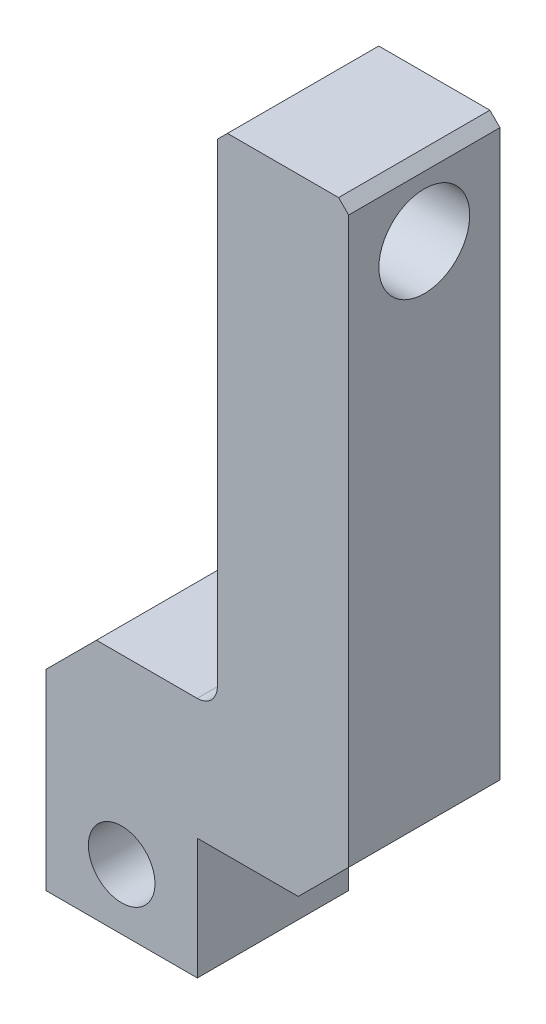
ISO-10303-21;
HEADER;
FILE_DESCRIPTION(('STEP AP214'),'2;1');
FILE_NAME('part.step','',(''),(''),'','','');
FILE_SCHEMA(('AUTOMOTIVE_DESIGN { 1 0 10303 214 1 1 1 1 }'));
ENDSEC;
DATA;
#1=APPLICATION_CONTEXT('core data for automotive mechanical design processes');
#2=APPLICATION_PROTOCOL_DEFINITION('international standard','automotive_design',2000,#1);
#3=PRODUCT_CONTEXT('',#1,'mechanical');
#4=PRODUCT('Part','Part','',(#3));
#5=PRODUCT_RELATED_PRODUCT_CATEGORY('part','',(#4));
#6=PRODUCT_DEFINITION_FORMATION('','',#4);
#7=PRODUCT_DEFINITION_CONTEXT('part definition',#1,'design');
#8=PRODUCT_DEFINITION('design','',#6,#7);
#9=PRODUCT_DEFINITION_SHAPE('','',#8);
#10=(LENGTH_UNIT() NAMED_UNIT(*) SI_UNIT(.MILLI.,.METRE.));
#11=(NAMED_UNIT(*) PLANE_ANGLE_UNIT() SI_UNIT($,.RADIAN.));
#12=(NAMED_UNIT(*) SI_UNIT($,.STERADIAN.) SOLID_ANGLE_UNIT());
#13=UNCERTAINTY_MEASURE_WITH_UNIT(LENGTH_MEASURE(1.E-05),#10,'distance_accuracy_value','');
#14=(GEOMETRIC_REPRESENTATION_CONTEXT(3) GLOBAL_UNCERTAINTY_ASSIGNED_CONTEXT((#13)) GLOBAL_UNIT_ASSIGNED_CONTEXT((#10,
#11,#12)) REPRESENTATION_CONTEXT('',''));
#15=CARTESIAN_POINT('',(0.,0.,0.));
#16=DIRECTION('',(0.,0.,1.));
#17=DIRECTION('',(1.,0.,0.));
#18=AXIS2_PLACEMENT_3D('',#15,#16,#17);
#19=CARTESIAN_POINT('',(0.,0.,15.));
#20=DIRECTION('',(0.,0.,1.));
#21=DIRECTION('',(1.,0.,0.));
#22=AXIS2_PLACEMENT_3D('',#19,#20,#21);
#23=PLANE('',#22);
#24=DIRECTION('',(0.,1.,0.));
#25=VECTOR('',#24,1.);
#26=CARTESIAN_POINT('',(153.4992259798,62.,15.));
#27=LINE('',#26,#25);
#28=CARTESIAN_POINT('',(153.4992259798,5.00000000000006,15.));
#29=VERTEX_POINT('',#28);
#30=CARTESIAN_POINT('',(153.4992259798,61.,15.));
#31=VERTEX_POINT('',#30);
#32=EDGE_CURVE('E167',#29,#31,#27,.T.);
#33=ORIENTED_EDGE('',*,*,#32,.T.);
#34=DIRECTION('',(0.707106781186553,-0.707106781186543,0.));
#35=VECTOR('',#34,1.);
#36=CARTESIAN_POINT('',(107.249612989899,107.2496129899,15.));
#37=LINE('',#36,#35);
#38=CARTESIAN_POINT('',(152.4992259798,62.,15.));
#39=VERTEX_POINT('',#38);
#40=EDGE_CURVE('E24',#31,#39,#37,.F.);
#41=ORIENTED_EDGE('',*,*,#40,.T.);
#42=DIRECTION('',(-1.,0.,0.));
#43=VECTOR('',#42,1.);
#44=CARTESIAN_POINT('',(140.481760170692,62.,15.));
#45=LINE('',#44,#43);
#46=CARTESIAN_POINT('',(141.481760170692,62.,15.));
#47=VERTEX_POINT('',#46);
#48=EDGE_CURVE('E209',#39,#47,#45,.T.);
#49=ORIENTED_EDGE('',*,*,#48,.T.);
#50=DIRECTION('',(0.707106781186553,0.707106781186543,0.));
#51=VECTOR('',#50,1.);
#52=CARTESIAN_POINT('',(39.7408800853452,-39.7408800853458,15.));
#53=LINE('',#52,#51);
#54=CARTESIAN_POINT('',(140.481760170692,61.,15.));
#55=VERTEX_POINT('',#54);
#56=EDGE_CURVE('E31',#47,#55,#53,.F.);
#57=ORIENTED_EDGE('',*,*,#56,.T.);
#58=DIRECTION('',(0.,-1.,0.));
#59=VECTOR('',#58,1.);
#60=CARTESIAN_POINT('',(140.481760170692,62.,15.));
#61=LINE('',#60,#59);
#62=CARTESIAN_POINT('',(140.481760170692,14.,15.));
#63=VERTEX_POINT('',#62);
#64=EDGE_CURVE('E216',#55,#63,#61,.T.);
#65=ORIENTED_EDGE('',*,*,#64,.T.);
#66=CARTESIAN_POINT('',(138.481760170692,14.,15.));
#67=DIRECTION('',(0.,0.,1.));
#68=DIRECTION('',(1.,0.,0.));
#69=AXIS2_PLACEMENT_3D('',#66,#67,#68);
#70=CIRCLE('',#69,2.);
#71=CARTESIAN_POINT('',(138.481760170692,12.,15.));
#72=VERTEX_POINT('',#71);
#73=EDGE_CURVE('E179',#63,#72,#70,.F.);
#74=ORIENTED_EDGE('',*,*,#73,.T.);
#75=DIRECTION('',(-1.,0.,0.));
#76=VECTOR('',#75,1.);
#77=CARTESIAN_POINT('',(123.4992259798,12.,15.));
#78=LINE('',#77,#76);
#79=CARTESIAN_POINT('',(128.4992259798,12.,15.));
#80=VERTEX_POINT('',#79);
#81=EDGE_CURVE('E124',#72,#80,#78,.T.);
#82=ORIENTED_EDGE('',*,*,#81,.T.);
#83=DIRECTION('',(0.707106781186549,0.707106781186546,0.));
#84=VECTOR('',#83,1.);
#85=CARTESIAN_POINT('',(58.2496129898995,-58.2496129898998,15.));
#86=LINE('',#85,#84);
#87=CARTESIAN_POINT('',(123.4992259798,7.,15.));
#88=VERTEX_POINT('',#87);
#89=EDGE_CURVE('E120',#80,#88,#86,.F.);
#90=ORIENTED_EDGE('',*,*,#89,.T.);
#91=DIRECTION('',(0.,-1.,0.));
#92=VECTOR('',#91,1.);
#93=CARTESIAN_POINT('',(123.4992259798,-12.,15.));
#94=LINE('',#93,#92);
#95=CARTESIAN_POINT('',(123.4992259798,-12.,15.));
#96=VERTEX_POINT('',#95);
#97=EDGE_CURVE('E112',#88,#96,#94,.T.);
#98=ORIENTED_EDGE('',*,*,#97,.T.);
#99=DIRECTION('',(1.,0.,0.));
#100=VECTOR('',#99,1.);
#101=CARTESIAN_POINT('',(138.4992259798,-12.,15.));
#102=LINE('',#101,#100);
#103=CARTESIAN_POINT('',(138.4992259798,-12.,15.));
#104=VERTEX_POINT('',#103);
#105=EDGE_CURVE('E116',#96,#104,#102,.T.);
#106=ORIENTED_EDGE('',*,*,#105,.T.);
#107=DIRECTION('',(0.,1.,0.));
#108=VECTOR('',#107,1.);
#109=CARTESIAN_POINT('',(138.4992259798,-12.,15.));
#110=LINE('',#109,#108);
#111=CARTESIAN_POINT('',(138.4992259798,0.,15.));
#112=VERTEX_POINT('',#111);
#113=EDGE_CURVE('E139',#104,#112,#110,.T.);
#114=ORIENTED_EDGE('',*,*,#113,.T.);
#115=DIRECTION('',(1.,0.,0.));
#116=VECTOR('',#115,1.);
#117=CARTESIAN_POINT('',(138.4992259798,0.,15.));
#118=LINE('',#117,#116);
#119=CARTESIAN_POINT('',(148.4992259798,0.,15.));
#120=VERTEX_POINT('',#119);
#121=EDGE_CURVE('E141',#112,#120,#118,.T.);
#122=ORIENTED_EDGE('',*,*,#121,.T.);
#123=DIRECTION('',(-0.707106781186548,-0.707106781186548,0.));
#124=VECTOR('',#123,1.);
#125=CARTESIAN_POINT('',(74.2496129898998,-74.2496129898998,15.));
#126=LINE('',#125,#124);
#127=EDGE_CURVE('E191',#120,#29,#126,.F.);
#128=ORIENTED_EDGE('',*,*,#127,.T.);
#129=EDGE_LOOP('',(#33,#41,#49,#57,#65,#74,#82,#90,#98,#106,#114,#122,#128));
#130=FACE_BOUND('',#129,.T.);
#131=CARTESIAN_POINT('',(130.9992259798,-6.,15.));
#132=DIRECTION('',(0.,0.,-1.));
#133=DIRECTION('',(-1.,0.,0.));
#134=AXIS2_PLACEMENT_3D('',#131,#132,#133);
#135=CIRCLE('',#134,3.3);
#136=CARTESIAN_POINT('',(127.6992259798,-6.,15.));
#137=VERTEX_POINT('',#136);
#138=EDGE_CURVE('E302',#137,#137,#135,.T.);
#139=ORIENTED_EDGE('',*,*,#138,.T.);
#140=EDGE_LOOP('',(#139));
#141=FACE_BOUND('',#140,.T.);
#142=ADVANCED_FACE('F16',(#130,#141),#23,.T.);
#143=CARTESIAN_POINT('',(153.4992259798,62.,15.));
#144=DIRECTION('',(-1.,0.,0.));
#145=DIRECTION('',(0.,0.,1.));
#146=AXIS2_PLACEMENT_3D('',#143,#144,#145);
#147=PLANE('',#146);
#148=CARTESIAN_POINT('',(153.4992259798,55.,7.5));
#149=DIRECTION('',(-1.,0.,0.));
#150=DIRECTION('',(0.,0.,1.));
#151=AXIS2_PLACEMENT_3D('',#148,#149,#150);
#152=CIRCLE('',#151,4.5);
#153=CARTESIAN_POINT('',(153.4992259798,55.,12.));
#154=VERTEX_POINT('',#153);
#155=EDGE_CURVE('E151',#154,#154,#152,.T.);
#156=ORIENTED_EDGE('',*,*,#155,.T.);
#157=EDGE_LOOP('',(#156));
#158=FACE_BOUND('',#157,.T.);
#159=DIRECTION('',(0.,1.,0.));
#160=VECTOR('',#159,1.);
#161=CARTESIAN_POINT('',(153.4992259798,62.,0.));
#162=LINE('',#161,#160);
#163=CARTESIAN_POINT('',(153.4992259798,5.,0.));
#164=VERTEX_POINT('',#163);
#165=CARTESIAN_POINT('',(153.4992259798,61.,0.));
#166=VERTEX_POINT('',#165);
#167=EDGE_CURVE('E148',#164,#166,#162,.T.);
#168=ORIENTED_EDGE('',*,*,#167,.T.);
#169=DIRECTION('',(0.,0.,1.));
#170=VECTOR('',#169,1.);
#171=CARTESIAN_POINT('',(153.4992259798,61.,15.));
#172=LINE('',#171,#170);
#173=EDGE_CURVE('E39',#166,#31,#172,.T.);
#174=ORIENTED_EDGE('',*,*,#173,.T.);
#175=ORIENTED_EDGE('',*,*,#32,.F.);
#176=DIRECTION('',(0.,0.,-1.));
#177=VECTOR('',#176,1.);
#178=CARTESIAN_POINT('',(153.4992259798,5.,15.));
#179=LINE('',#178,#177);
#180=EDGE_CURVE('E181',#29,#164,#179,.T.);
#181=ORIENTED_EDGE('',*,*,#180,.T.);
#182=EDGE_LOOP('',(#168,#174,#175,#181));
#183=FACE_BOUND('',#182,.T.);
#184=ADVANCED_FACE('F222',(#158,#183),#147,.F.);
#185=CARTESIAN_POINT('',(140.481760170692,62.,15.));
#186=DIRECTION('',(0.,-1.,0.));
#187=DIRECTION('',(0.,0.,-1.));
#188=AXIS2_PLACEMENT_3D('',#185,#186,#187);
#189=PLANE('',#188);
#190=ORIENTED_EDGE('',*,*,#48,.F.);
#191=DIRECTION('',(0.,0.,-1.));
#192=VECTOR('',#191,1.);
#193=CARTESIAN_POINT('',(152.4992259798,62.,15.));
#194=LINE('',#193,#192);
#195=CARTESIAN_POINT('',(152.4992259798,62.,0.));
#196=VERTEX_POINT('',#195);
#197=EDGE_CURVE('E199',#39,#196,#194,.T.);
#198=ORIENTED_EDGE('',*,*,#197,.T.);
#199=DIRECTION('',(-1.,0.,0.));
#200=VECTOR('',#199,1.);
#201=CARTESIAN_POINT('',(140.481760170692,62.,0.));
#202=LINE('',#201,#200);
#203=CARTESIAN_POINT('',(141.481760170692,62.,0.));
#204=VERTEX_POINT('',#203);
#205=EDGE_CURVE('E150',#196,#204,#202,.T.);
#206=ORIENTED_EDGE('',*,*,#205,.T.);
#207=DIRECTION('',(0.,0.,1.));
#208=VECTOR('',#207,1.);
#209=CARTESIAN_POINT('',(141.481760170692,62.,15.));
#210=LINE('',#209,#208);
#211=EDGE_CURVE('E197',#204,#47,#210,.T.);
#212=ORIENTED_EDGE('',*,*,#211,.T.);
#213=EDGE_LOOP('',(#190,#198,#206,#212));
#214=FACE_BOUND('',#213,.T.);
#215=ADVANCED_FACE('F213',(#214),#189,.F.);
#216=CARTESIAN_POINT('',(140.481760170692,62.,15.));
#217=DIRECTION('',(1.,0.,0.));
#218=DIRECTION('',(0.,0.,-1.));
#219=AXIS2_PLACEMENT_3D('',#216,#217,#218);
#220=PLANE('',#219);
#221=CARTESIAN_POINT('',(140.481760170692,55.,7.5));
#222=DIRECTION('',(-1.,0.,0.));
#223=DIRECTION('',(0.,0.,1.));
#224=AXIS2_PLACEMENT_3D('',#221,#222,#223);
#225=CIRCLE('',#224,4.5);
#226=CARTESIAN_POINT('',(140.481760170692,55.,12.));
#227=VERTEX_POINT('',#226);
#228=EDGE_CURVE('E299',#227,#227,#225,.T.);
#229=ORIENTED_EDGE('',*,*,#228,.F.);
#230=EDGE_LOOP('',(#229));
#231=FACE_BOUND('',#230,.T.);
#232=ORIENTED_EDGE('',*,*,#64,.F.);
#233=DIRECTION('',(0.,0.,-1.));
#234=VECTOR('',#233,1.);
#235=CARTESIAN_POINT('',(140.481760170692,61.,15.));
#236=LINE('',#235,#234);
#237=CARTESIAN_POINT('',(140.481760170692,61.,0.));
#238=VERTEX_POINT('',#237);
#239=EDGE_CURVE('E11',#55,#238,#236,.T.);
#240=ORIENTED_EDGE('',*,*,#239,.T.);
#241=DIRECTION('',(0.,-1.,0.));
#242=VECTOR('',#241,1.);
#243=CARTESIAN_POINT('',(140.481760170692,62.,0.));
#244=LINE('',#243,#242);
#245=CARTESIAN_POINT('',(140.481760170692,14.,0.));
#246=VERTEX_POINT('',#245);
#247=EDGE_CURVE('E154',#238,#246,#244,.T.);
#248=ORIENTED_EDGE('',*,*,#247,.T.);
#249=DIRECTION('',(0.,0.,-1.));
#250=VECTOR('',#249,1.);
#251=CARTESIAN_POINT('',(140.481760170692,14.,15.));
#252=LINE('',#251,#250);
#253=EDGE_CURVE('E173',#246,#63,#252,.F.);
#254=ORIENTED_EDGE('',*,*,#253,.T.);
#255=EDGE_LOOP('',(#232,#240,#248,#254));
#256=FACE_BOUND('',#255,.T.);
#257=ADVANCED_FACE('F279',(#231,#256),#220,.F.);
#258=CARTESIAN_POINT('',(123.4992259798,12.,15.));
#259=DIRECTION('',(0.,-1.,0.));
#260=DIRECTION('',(0.,0.,-1.));
#261=AXIS2_PLACEMENT_3D('',#258,#259,#260);
#262=PLANE('',#261);
#263=DIRECTION('',(-1.,0.,0.));
#264=VECTOR('',#263,1.);
#265=CARTESIAN_POINT('',(123.4992259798,12.,0.));
#266=LINE('',#265,#264);
#267=CARTESIAN_POINT('',(138.481760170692,12.,0.));
#268=VERTEX_POINT('',#267);
#269=CARTESIAN_POINT('',(128.4992259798,12.,0.));
#270=VERTEX_POINT('',#269);
#271=EDGE_CURVE('E156',#268,#270,#266,.T.);
#272=ORIENTED_EDGE('',*,*,#271,.T.);
#273=DIRECTION('',(0.,0.,1.));
#274=VECTOR('',#273,1.);
#275=CARTESIAN_POINT('',(128.4992259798,12.,15.));
#276=LINE('',#275,#274);
#277=EDGE_CURVE('E195',#270,#80,#276,.T.);
#278=ORIENTED_EDGE('',*,*,#277,.T.);
#279=ORIENTED_EDGE('',*,*,#81,.F.);
#280=DIRECTION('',(0.,0.,-1.));
#281=VECTOR('',#280,1.);
#282=CARTESIAN_POINT('',(138.481760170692,12.,0.));
#283=LINE('',#282,#281);
#284=EDGE_CURVE('E133',#72,#268,#283,.T.);
#285=ORIENTED_EDGE('',*,*,#284,.T.);
#286=EDGE_LOOP('',(#272,#278,#279,#285));
#287=FACE_BOUND('',#286,.T.);
#288=ADVANCED_FACE('F240',(#287),#262,.F.);
#289=CARTESIAN_POINT('',(123.4992259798,-12.,15.));
#290=DIRECTION('',(1.,0.,0.));
#291=DIRECTION('',(0.,0.,-1.));
#292=AXIS2_PLACEMENT_3D('',#289,#290,#291);
#293=PLANE('',#292);
#294=ORIENTED_EDGE('',*,*,#97,.F.);
#295=DIRECTION('',(0.,0.,-1.));
#296=VECTOR('',#295,1.);
#297=CARTESIAN_POINT('',(123.4992259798,7.,15.));
#298=LINE('',#297,#296);
#299=CARTESIAN_POINT('',(123.4992259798,7.,0.));
#300=VERTEX_POINT('',#299);
#301=EDGE_CURVE('E193',#88,#300,#298,.T.);
#302=ORIENTED_EDGE('',*,*,#301,.T.);
#303=DIRECTION('',(0.,-1.,0.));
#304=VECTOR('',#303,1.);
#305=CARTESIAN_POINT('',(123.4992259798,-12.,0.));
#306=LINE('',#305,#304);
#307=CARTESIAN_POINT('',(123.4992259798,-12.,0.));
#308=VERTEX_POINT('',#307);
#309=EDGE_CURVE('E130',#300,#308,#306,.T.);
#310=ORIENTED_EDGE('',*,*,#309,.T.);
#311=DIRECTION('',(0.,0.,-1.));
#312=VECTOR('',#311,1.);
#313=CARTESIAN_POINT('',(123.4992259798,-12.,15.));
#314=LINE('',#313,#312);
#315=EDGE_CURVE('E127',#96,#308,#314,.T.);
#316=ORIENTED_EDGE('',*,*,#315,.F.);
#317=EDGE_LOOP('',(#294,#302,#310,#316));
#318=FACE_BOUND('',#317,.T.);
#319=ADVANCED_FACE('F128',(#318),#293,.F.);
#320=CARTESIAN_POINT('',(138.4992259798,-12.,15.));
#321=DIRECTION('',(0.,1.,0.));
#322=DIRECTION('',(-1.,0.,0.));
#323=AXIS2_PLACEMENT_3D('',#320,#321,#322);
#324=PLANE('',#323);
#325=DIRECTION('',(1.,0.,0.));
#326=VECTOR('',#325,1.);
#327=CARTESIAN_POINT('',(138.4992259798,-12.,0.));
#328=LINE('',#327,#326);
#329=CARTESIAN_POINT('',(138.4992259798,-12.,0.));
#330=VERTEX_POINT('',#329);
#331=EDGE_CURVE('E160',#308,#330,#328,.T.);
#332=ORIENTED_EDGE('',*,*,#331,.T.);
#333=DIRECTION('',(0.,0.,-1.));
#334=VECTOR('',#333,1.);
#335=CARTESIAN_POINT('',(138.4992259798,-12.,15.));
#336=LINE('',#335,#334);
#337=EDGE_CURVE('E134',#104,#330,#336,.T.);
#338=ORIENTED_EDGE('',*,*,#337,.F.);
#339=ORIENTED_EDGE('',*,*,#105,.F.);
#340=ORIENTED_EDGE('',*,*,#315,.T.);
#341=EDGE_LOOP('',(#332,#338,#339,#340));
#342=FACE_BOUND('',#341,.T.);
#343=ADVANCED_FACE('F136',(#342),#324,.F.);
#344=CARTESIAN_POINT('',(138.4992259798,-12.,15.));
#345=DIRECTION('',(-1.,0.,0.));
#346=DIRECTION('',(0.,0.,1.));
#347=AXIS2_PLACEMENT_3D('',#344,#345,#346);
#348=PLANE('',#347);
#349=DIRECTION('',(0.,1.,0.));
#350=VECTOR('',#349,1.);
#351=CARTESIAN_POINT('',(138.4992259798,-12.,0.));
#352=LINE('',#351,#350);
#353=CARTESIAN_POINT('',(138.4992259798,0.,0.));
#354=VERTEX_POINT('',#353);
#355=EDGE_CURVE('E162',#330,#354,#352,.T.);
#356=ORIENTED_EDGE('',*,*,#355,.T.);
#357=DIRECTION('',(0.,0.,-1.));
#358=VECTOR('',#357,1.);
#359=CARTESIAN_POINT('',(138.4992259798,0.,15.));
#360=LINE('',#359,#358);
#361=EDGE_CURVE('E147',#112,#354,#360,.T.);
#362=ORIENTED_EDGE('',*,*,#361,.F.);
#363=ORIENTED_EDGE('',*,*,#113,.F.);
#364=ORIENTED_EDGE('',*,*,#337,.T.);
#365=EDGE_LOOP('',(#356,#362,#363,#364));
#366=FACE_BOUND('',#365,.T.);
#367=ADVANCED_FACE('F235',(#366),#348,.F.);
#368=CARTESIAN_POINT('',(138.4992259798,0.,15.));
#369=DIRECTION('',(0.,1.,0.));
#370=DIRECTION('',(0.,0.,1.));
#371=AXIS2_PLACEMENT_3D('',#368,#369,#370);
#372=PLANE('',#371);
#373=DIRECTION('',(1.,0.,0.));
#374=VECTOR('',#373,1.);
#375=CARTESIAN_POINT('',(138.4992259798,0.,0.));
#376=LINE('',#375,#374);
#377=CARTESIAN_POINT('',(148.4992259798,0.,0.));
#378=VERTEX_POINT('',#377);
#379=EDGE_CURVE('E164',#354,#378,#376,.T.);
#380=ORIENTED_EDGE('',*,*,#379,.T.);
#381=DIRECTION('',(0.,0.,1.));
#382=VECTOR('',#381,1.);
#383=CARTESIAN_POINT('',(148.4992259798,0.,15.));
#384=LINE('',#383,#382);
#385=EDGE_CURVE('E188',#378,#120,#384,.T.);
#386=ORIENTED_EDGE('',*,*,#385,.T.);
#387=ORIENTED_EDGE('',*,*,#121,.F.);
#388=ORIENTED_EDGE('',*,*,#361,.T.);
#389=EDGE_LOOP('',(#380,#386,#387,#388));
#390=FACE_BOUND('',#389,.T.);
#391=ADVANCED_FACE('F231',(#390),#372,.F.);
#392=CARTESIAN_POINT('',(0.,0.,0.));
#393=DIRECTION('',(0.,0.,1.));
#394=DIRECTION('',(1.,0.,0.));
#395=AXIS2_PLACEMENT_3D('',#392,#393,#394);
#396=PLANE('',#395);
#397=CARTESIAN_POINT('',(130.9992259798,-6.,0.));
#398=DIRECTION('',(0.,0.,-1.));
#399=DIRECTION('',(-1.,0.,0.));
#400=AXIS2_PLACEMENT_3D('',#397,#398,#399);
#401=CIRCLE('',#400,5.5);
#402=CARTESIAN_POINT('',(125.4992259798,-6.,0.));
#403=VERTEX_POINT('',#402);
#404=EDGE_CURVE('E311',#403,#403,#401,.T.);
#405=ORIENTED_EDGE('',*,*,#404,.F.);
#406=EDGE_LOOP('',(#405));
#407=FACE_BOUND('',#406,.T.);
#408=ORIENTED_EDGE('',*,*,#205,.F.);
#409=DIRECTION('',(-0.707106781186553,0.707106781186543,0.));
#410=VECTOR('',#409,1.);
#411=CARTESIAN_POINT('',(152.4992259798,62.,0.));
#412=LINE('',#411,#410);
#413=EDGE_CURVE('E204',#196,#166,#412,.F.);
#414=ORIENTED_EDGE('',*,*,#413,.T.);
#415=ORIENTED_EDGE('',*,*,#167,.F.);
#416=DIRECTION('',(0.707106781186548,0.707106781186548,0.));
#417=VECTOR('',#416,1.);
#418=CARTESIAN_POINT('',(153.4992259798,5.,0.));
#419=LINE('',#418,#417);
#420=EDGE_CURVE('E186',#164,#378,#419,.F.);
#421=ORIENTED_EDGE('',*,*,#420,.T.);
#422=ORIENTED_EDGE('',*,*,#379,.F.);
#423=ORIENTED_EDGE('',*,*,#355,.F.);
#424=ORIENTED_EDGE('',*,*,#331,.F.);
#425=ORIENTED_EDGE('',*,*,#309,.F.);
#426=DIRECTION('',(-0.707106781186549,-0.707106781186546,0.));
#427=VECTOR('',#426,1.);
#428=CARTESIAN_POINT('',(123.4992259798,7.,0.));
#429=LINE('',#428,#427);
#430=EDGE_CURVE('E184',#300,#270,#429,.F.);
#431=ORIENTED_EDGE('',*,*,#430,.T.);
#432=ORIENTED_EDGE('',*,*,#271,.F.);
#433=CARTESIAN_POINT('',(138.481760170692,14.,0.));
#434=DIRECTION('',(0.,0.,1.));
#435=DIRECTION('',(1.,0.,0.));
#436=AXIS2_PLACEMENT_3D('',#433,#434,#435);
#437=CIRCLE('',#436,2.);
#438=EDGE_CURVE('E176',#268,#246,#437,.T.);
#439=ORIENTED_EDGE('',*,*,#438,.T.);
#440=ORIENTED_EDGE('',*,*,#247,.F.);
#441=DIRECTION('',(-0.707106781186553,-0.707106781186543,0.));
#442=VECTOR('',#441,1.);
#443=CARTESIAN_POINT('',(140.481760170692,61.,0.));
#444=LINE('',#443,#442);
#445=EDGE_CURVE('E202',#238,#204,#444,.F.);
#446=ORIENTED_EDGE('',*,*,#445,.T.);
#447=EDGE_LOOP('',(#408,#414,#415,#421,#422,#423,#424,#425,#431,#432,#439,#440,#446));
#448=FACE_BOUND('',#447,.T.);
#449=ADVANCED_FACE('F221',(#407,#448),#396,.F.);
#450=CARTESIAN_POINT('',(140.481760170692,55.,7.5));
#451=DIRECTION('',(-1.,0.,0.));
#452=DIRECTION('',(0.,0.,1.));
#453=AXIS2_PLACEMENT_3D('',#450,#451,#452);
#454=CYLINDRICAL_SURFACE('',#453,4.5);
#455=ORIENTED_EDGE('',*,*,#155,.F.);
#456=EDGE_LOOP('',(#455));
#457=FACE_BOUND('',#456,.T.);
#458=ORIENTED_EDGE('',*,*,#228,.T.);
#459=EDGE_LOOP('',(#458));
#460=FACE_BOUND('',#459,.T.);
#461=ADVANCED_FACE('F264',(#457,#460),#454,.F.);
#462=CARTESIAN_POINT('',(138.481760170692,14.,15.));
#463=DIRECTION('',(0.,0.,1.));
#464=DIRECTION('',(1.,0.,0.));
#465=AXIS2_PLACEMENT_3D('',#462,#463,#464);
#466=CYLINDRICAL_SURFACE('',#465,2.);
#467=ORIENTED_EDGE('',*,*,#73,.F.);
#468=ORIENTED_EDGE('',*,*,#253,.F.);
#469=ORIENTED_EDGE('',*,*,#438,.F.);
#470=ORIENTED_EDGE('',*,*,#284,.F.);
#471=EDGE_LOOP('',(#467,#468,#469,#470));
#472=FACE_BOUND('',#471,.T.);
#473=ADVANCED_FACE('F252',(#472),#466,.F.);
#474=CARTESIAN_POINT('',(153.4992259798,5.,15.));
#475=DIRECTION('',(-0.707106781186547,0.707106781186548,0.));
#476=DIRECTION('',(0.,0.,-1.));
#477=AXIS2_PLACEMENT_3D('',#474,#475,#476);
#478=PLANE('',#477);
#479=ORIENTED_EDGE('',*,*,#127,.F.);
#480=ORIENTED_EDGE('',*,*,#385,.F.);
#481=ORIENTED_EDGE('',*,*,#420,.F.);
#482=ORIENTED_EDGE('',*,*,#180,.F.);
#483=EDGE_LOOP('',(#479,#480,#481,#482));
#484=FACE_BOUND('',#483,.T.);
#485=ADVANCED_FACE('F226',(#484),#478,.F.);
#486=CARTESIAN_POINT('',(123.4992259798,7.,15.));
#487=DIRECTION('',(0.707106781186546,-0.707106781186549,0.));
#488=DIRECTION('',(0.,0.,-1.));
#489=AXIS2_PLACEMENT_3D('',#486,#487,#488);
#490=PLANE('',#489);
#491=ORIENTED_EDGE('',*,*,#89,.F.);
#492=ORIENTED_EDGE('',*,*,#277,.F.);
#493=ORIENTED_EDGE('',*,*,#430,.F.);
#494=ORIENTED_EDGE('',*,*,#301,.F.);
#495=EDGE_LOOP('',(#491,#492,#493,#494));
#496=FACE_BOUND('',#495,.T.);
#497=ADVANCED_FACE('F243',(#496),#490,.F.);
#498=CARTESIAN_POINT('',(152.4992259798,62.,15.));
#499=DIRECTION('',(-0.707106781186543,-0.707106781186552,0.));
#500=DIRECTION('',(0.,0.,-1.));
#501=AXIS2_PLACEMENT_3D('',#498,#499,#500);
#502=PLANE('',#501);
#503=ORIENTED_EDGE('',*,*,#40,.F.);
#504=ORIENTED_EDGE('',*,*,#173,.F.);
#505=ORIENTED_EDGE('',*,*,#413,.F.);
#506=ORIENTED_EDGE('',*,*,#197,.F.);
#507=EDGE_LOOP('',(#503,#504,#505,#506));
#508=FACE_BOUND('',#507,.T.);
#509=ADVANCED_FACE('F218',(#508),#502,.F.);
#510=CARTESIAN_POINT('',(140.481760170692,61.,15.));
#511=DIRECTION('',(0.707106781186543,-0.707106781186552,0.));
#512=DIRECTION('',(0.,0.,-1.));
#513=AXIS2_PLACEMENT_3D('',#510,#511,#512);
#514=PLANE('',#513);
#515=ORIENTED_EDGE('',*,*,#56,.F.);
#516=ORIENTED_EDGE('',*,*,#211,.F.);
#517=ORIENTED_EDGE('',*,*,#445,.F.);
#518=ORIENTED_EDGE('',*,*,#239,.F.);
#519=EDGE_LOOP('',(#515,#516,#517,#518));
#520=FACE_BOUND('',#519,.T.);
#521=ADVANCED_FACE('F18',(#520),#514,.F.);
#522=CARTESIAN_POINT('',(130.9992259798,-6.,0.));
#523=DIRECTION('',(0.,0.,-1.));
#524=DIRECTION('',(-1.,0.,0.));
#525=AXIS2_PLACEMENT_3D('',#522,#523,#524);
#526=CYLINDRICAL_SURFACE('',#525,3.3);
#527=ORIENTED_EDGE('',*,*,#138,.F.);
#528=EDGE_LOOP('',(#527));
#529=FACE_BOUND('',#528,.T.);
#530=CARTESIAN_POINT('',(130.9992259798,-6.,6.8));
#531=DIRECTION('',(0.,0.,-1.));
#532=DIRECTION('',(-1.,0.,0.));
#533=AXIS2_PLACEMENT_3D('',#530,#531,#532);
#534=CIRCLE('',#533,3.3);
#535=CARTESIAN_POINT('',(127.6992259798,-6.,6.8));
#536=VERTEX_POINT('',#535);
#537=EDGE_CURVE('E305',#536,#536,#534,.T.);
#538=ORIENTED_EDGE('',*,*,#537,.T.);
#539=EDGE_LOOP('',(#538));
#540=FACE_BOUND('',#539,.T.);
#541=ADVANCED_FACE('F324',(#529,#540),#526,.F.);
#542=CARTESIAN_POINT('',(134.2992259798,-6.,6.8));
#543=DIRECTION('',(0.,0.,1.));
#544=DIRECTION('',(1.,0.,0.));
#545=AXIS2_PLACEMENT_3D('',#542,#543,#544);
#546=PLANE('',#545);
#547=ORIENTED_EDGE('',*,*,#537,.F.);
#548=EDGE_LOOP('',(#547));
#549=FACE_BOUND('',#548,.T.);
#550=CARTESIAN_POINT('',(130.9992259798,-6.,6.8));
#551=DIRECTION('',(0.,0.,-1.));
#552=DIRECTION('',(-1.,0.,0.));
#553=AXIS2_PLACEMENT_3D('',#550,#551,#552);
#554=CIRCLE('',#553,5.5);
#555=CARTESIAN_POINT('',(125.4992259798,-6.,6.8));
#556=VERTEX_POINT('',#555);
#557=EDGE_CURVE('E308',#556,#556,#554,.T.);
#558=ORIENTED_EDGE('',*,*,#557,.T.);
#559=EDGE_LOOP('',(#558));
#560=FACE_BOUND('',#559,.T.);
#561=ADVANCED_FACE('F317',(#549,#560),#546,.F.);
#562=CARTESIAN_POINT('',(130.9992259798,-6.,0.));
#563=DIRECTION('',(0.,0.,-1.));
#564=DIRECTION('',(-1.,0.,0.));
#565=AXIS2_PLACEMENT_3D('',#562,#563,#564);
#566=CYLINDRICAL_SURFACE('',#565,5.5);
#567=ORIENTED_EDGE('',*,*,#557,.F.);
#568=EDGE_LOOP('',(#567));
#569=FACE_BOUND('',#568,.T.);
#570=ORIENTED_EDGE('',*,*,#404,.T.);
#571=EDGE_LOOP('',(#570));
#572=FACE_BOUND('',#571,.T.);
#573=ADVANCED_FACE('F315',(#569,#572),#566,.F.);
#574=CLOSED_SHELL('',(#142,#184,#215,#257,#288,#319,#343,#367,#391,#449,#461,#473,#485,#497,
#509,#521,#541,#561,#573));
#575=MANIFOLD_SOLID_BREP('B1',#574);
#576=ADVANCED_BREP_SHAPE_REPRESENTATION('',(#18,#575),#14);
#577=SHAPE_DEFINITION_REPRESENTATION(#9,#576);
ENDSEC;
END-ISO-10303-21;
